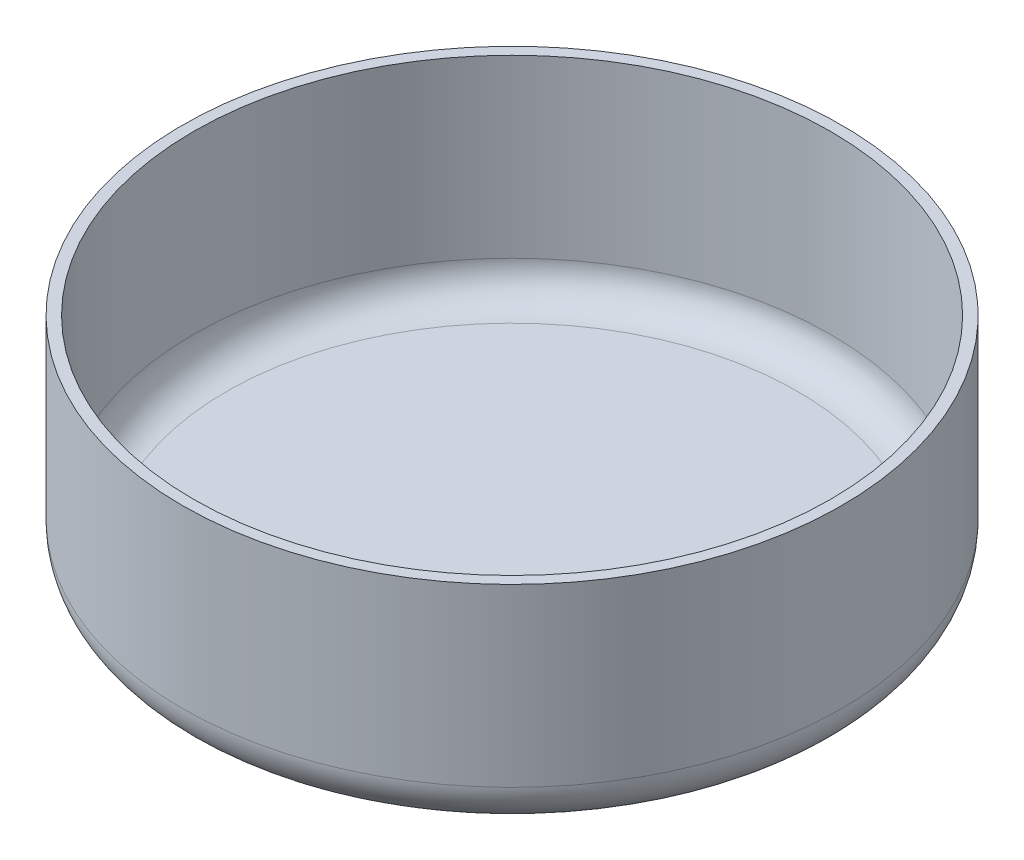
from build123d import *


with BuildPart() as part:
    # Sketch2 → Revolve1 (revolve)
    with BuildSketch(Plane.XY, mode=Mode.PRIVATE) as revolve1_sk:
        with BuildLine():
            Line((0, 0), (130, 0))
            ThreePointArc((130, 0), (144.142135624, 5.857864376), (150, 20))
            Line((150, 20), (150, 100))
            Line((150, 100), (145, 100))
            Line((145, 100), (145, 20))
            ThreePointArc((145, 20), (140.606601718, 9.393398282), (130, 5))
            Line((130, 5), (0, 5))
            Line((0, 5), (0, 0))
        make_face()
    revolve(revolve1_sk.sketch.rotate(Axis((0, 80.43670497, 0), (0, -1, 0)), 90), axis=Axis((0, 80.43670497, 0), (0, -1, 0)))


solid = part.part
